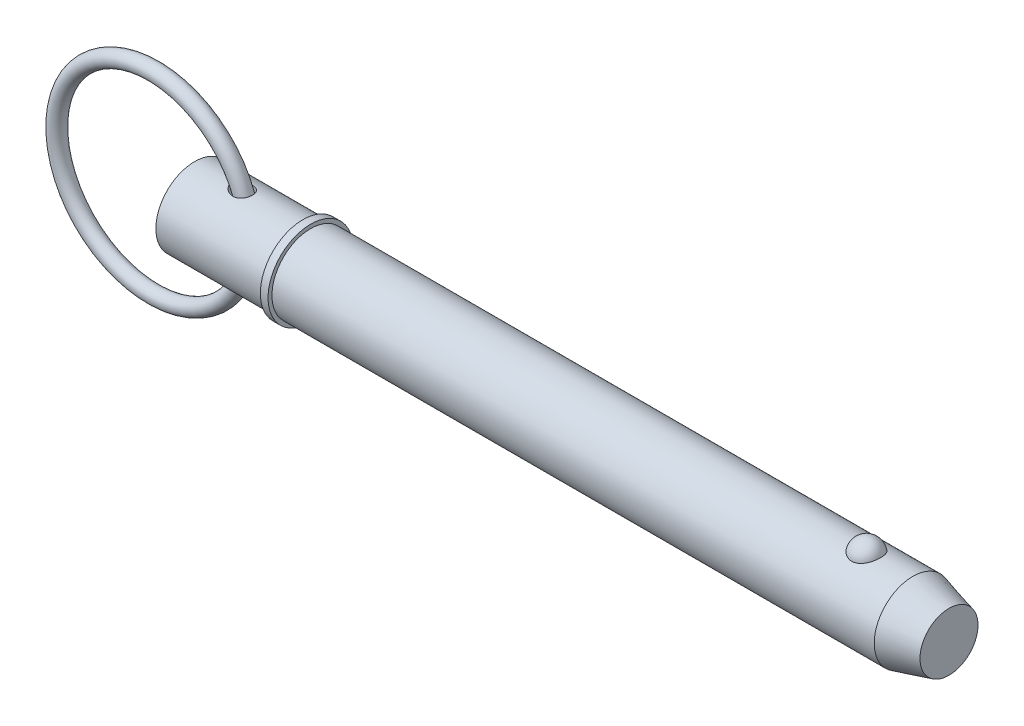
ISO-10303-21;
HEADER;
FILE_DESCRIPTION(('STEP AP214'),'2;1');
FILE_NAME('part.step','',(''),(''),'','','');
FILE_SCHEMA(('AUTOMOTIVE_DESIGN { 1 0 10303 214 1 1 1 1 }'));
ENDSEC;
DATA;
#1=APPLICATION_CONTEXT('core data for automotive mechanical design processes');
#2=APPLICATION_PROTOCOL_DEFINITION('international standard','automotive_design',2000,#1);
#3=PRODUCT_CONTEXT('',#1,'mechanical');
#4=PRODUCT('Part','Part','',(#3));
#5=PRODUCT_RELATED_PRODUCT_CATEGORY('part','',(#4));
#6=PRODUCT_DEFINITION_FORMATION('','',#4);
#7=PRODUCT_DEFINITION_CONTEXT('part definition',#1,'design');
#8=PRODUCT_DEFINITION('design','',#6,#7);
#9=PRODUCT_DEFINITION_SHAPE('','',#8);
#10=(LENGTH_UNIT() NAMED_UNIT(*) SI_UNIT(.MILLI.,.METRE.));
#11=(NAMED_UNIT(*) PLANE_ANGLE_UNIT() SI_UNIT($,.RADIAN.));
#12=(NAMED_UNIT(*) SI_UNIT($,.STERADIAN.) SOLID_ANGLE_UNIT());
#13=UNCERTAINTY_MEASURE_WITH_UNIT(LENGTH_MEASURE(1.E-05),#10,'distance_accuracy_value','');
#14=(GEOMETRIC_REPRESENTATION_CONTEXT(3) GLOBAL_UNCERTAINTY_ASSIGNED_CONTEXT((#13)) GLOBAL_UNIT_ASSIGNED_CONTEXT((#10,
#11,#12)) REPRESENTATION_CONTEXT('',''));
#15=CARTESIAN_POINT('',(0.,0.,0.));
#16=DIRECTION('',(0.,0.,1.));
#17=DIRECTION('',(1.,0.,0.));
#18=AXIS2_PLACEMENT_3D('',#15,#16,#17);
#19=CARTESIAN_POINT('',(-13.4840686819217,0.,0.));
#20=DIRECTION('',(0.,0.,1.));
#21=DIRECTION('',(1.,0.,0.));
#22=AXIS2_PLACEMENT_3D('',#19,#20,#21);
#23=TOROIDAL_SURFACE('',#22,31.75,2.54);
#24=CARTESIAN_POINT('',(20.8059313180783,0.,0.));
#25=VERTEX_POINT('',#24);
#26=VERTEX_LOOP('',#25);
#27=FACE_BOUND('',#26,.T.);
#28=ADVANCED_FACE('P0_F12',(#27),#23,.T.);
#29=CLOSED_SHELL('',(#28));
#30=MANIFOLD_SOLID_BREP('P0_B1',#29);
#31=CARTESIAN_POINT('',(0.,0.,0.));
#32=DIRECTION('',(1.,0.,0.));
#33=DIRECTION('',(0.,0.,-1.));
#34=AXIS2_PLACEMENT_3D('',#31,#32,#33);
#35=CYLINDRICAL_SURFACE('',#34,12.7);
#36=CARTESIAN_POINT('',(13.092900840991,12.5230976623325,-2.11234992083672));
#37=CARTESIAN_POINT('',(13.2535855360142,12.4976398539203,-2.26328363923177));
#38=CARTESIAN_POINT('',(13.4280602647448,12.4718592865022,-2.3995578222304));
#39=CARTESIAN_POINT('',(13.7976341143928,12.4229301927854,-2.64122157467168));
#40=CARTESIAN_POINT('',(13.9927568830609,12.3997847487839,-2.74657519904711));
#41=CARTESIAN_POINT('',(14.397672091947,12.3590534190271,-2.92439761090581));
#42=CARTESIAN_POINT('',(14.6074445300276,12.3414601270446,-2.99691026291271));
#43=CARTESIAN_POINT('',(15.0366557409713,12.3142893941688,-3.10669649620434));
#44=CARTESIAN_POINT('',(15.2560902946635,12.3047084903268,-3.14398530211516));
#45=CARTESIAN_POINT('',(15.5877843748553,12.2976819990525,-3.17128282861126));
#46=CARTESIAN_POINT('',(15.6989364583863,12.2965677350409,-3.17559470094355));
#47=CARTESIAN_POINT('',(15.9211629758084,12.2969101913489,-3.17427486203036));
#48=CARTESIAN_POINT('',(16.0322374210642,12.2983656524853,-3.16864802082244));
#49=CARTESIAN_POINT('',(16.2532861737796,12.3038832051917,-3.14715368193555));
#50=CARTESIAN_POINT('',(16.363260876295,12.3079443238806,-3.13129000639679));
#51=CARTESIAN_POINT('',(16.5810669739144,12.3185954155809,-3.08912320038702));
#52=CARTESIAN_POINT('',(16.6888986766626,12.3251850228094,-3.06282157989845));
#53=CARTESIAN_POINT('',(16.8894247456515,12.3398294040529,-3.00323791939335));
#54=CARTESIAN_POINT('',(16.9824664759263,12.3476389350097,-2.97106098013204));
#55=CARTESIAN_POINT('',(17.1651267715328,12.3648759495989,-2.89848824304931));
#56=CARTESIAN_POINT('',(17.2547457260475,12.3743032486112,-2.85809338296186));
#57=CARTESIAN_POINT('',(17.4297224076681,12.3944822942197,-2.76927391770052));
#58=CARTESIAN_POINT('',(17.5150817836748,12.40523352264,-2.72085245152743));
#59=CARTESIAN_POINT('',(17.6807665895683,12.4277046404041,-2.61629867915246));
#60=CARTESIAN_POINT('',(17.7610923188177,12.4394244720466,-2.56016683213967));
#61=CARTESIAN_POINT('',(17.9797287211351,12.4733252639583,-2.39133767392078));
#62=CARTESIAN_POINT('',(18.1114611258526,12.4961902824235,-2.27005507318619));
#63=CARTESIAN_POINT('',(18.3518677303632,12.5412050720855,-2.00648954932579));
#64=CARTESIAN_POINT('',(18.4605454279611,12.5633549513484,-1.86420981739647));
#65=CARTESIAN_POINT('',(18.6498843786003,12.6039384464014,-1.56614816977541));
#66=CARTESIAN_POINT('',(18.7311185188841,12.622444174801,-1.41073996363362));
#67=CARTESIAN_POINT('',(18.8669149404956,12.6543302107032,-1.08819514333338));
#68=CARTESIAN_POINT('',(18.921477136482,12.6677105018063,-0.921058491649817));
#69=CARTESIAN_POINT('',(19.0028875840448,12.6879542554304,-0.579029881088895));
#70=CARTESIAN_POINT('',(19.0296164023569,12.6947896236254,-0.404107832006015));
#71=CARTESIAN_POINT('',(19.0543673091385,12.7011128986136,-0.0521104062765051));
#72=CARTESIAN_POINT('',(19.0523885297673,12.7006005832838,0.124965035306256));
#73=CARTESIAN_POINT('',(19.019700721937,12.692266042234,0.476969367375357));
#74=CARTESIAN_POINT('',(18.9888798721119,12.6844153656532,0.651887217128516));
#75=CARTESIAN_POINT('',(18.8990221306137,12.6622099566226,0.99389064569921));
#76=CARTESIAN_POINT('',(18.839985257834,12.6478552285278,1.16097622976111));
#77=CARTESIAN_POINT('',(18.6951419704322,12.6142309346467,1.48231767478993));
#78=CARTESIAN_POINT('',(18.6093706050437,12.5949678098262,1.63659000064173));
#79=CARTESIAN_POINT('',(18.4131352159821,12.5536490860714,1.92810749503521));
#80=CARTESIAN_POINT('',(18.3026732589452,12.5315937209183,2.06535408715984));
#81=CARTESIAN_POINT('',(18.060669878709,12.4872833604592,2.31822774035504));
#82=CARTESIAN_POINT('',(17.9292520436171,12.4650302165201,2.43397343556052));
#83=CARTESIAN_POINT('',(17.6485957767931,12.4226514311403,2.64178289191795));
#84=CARTESIAN_POINT('',(17.4993587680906,12.4025256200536,2.73384854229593));
#85=CARTESIAN_POINT('',(17.1869531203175,12.3664726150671,2.8925825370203));
#86=CARTESIAN_POINT('',(17.0237450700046,12.3505578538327,2.95917592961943));
#87=CARTESIAN_POINT('',(16.6884731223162,12.3245177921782,3.06582547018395));
#88=CARTESIAN_POINT('',(16.516407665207,12.3143935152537,3.10587692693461));
#89=CARTESIAN_POINT('',(16.1604213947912,12.3003788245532,3.16093927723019));
#90=CARTESIAN_POINT('',(15.9763106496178,12.2967791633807,3.17478342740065));
#91=CARTESIAN_POINT('',(15.6080973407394,12.2966663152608,3.17521180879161));
#92=CARTESIAN_POINT('',(15.4239948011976,12.3001555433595,3.16178674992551));
#93=CARTESIAN_POINT('',(15.0417156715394,12.3141744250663,3.10676725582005));
#94=CARTESIAN_POINT('',(14.8439465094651,12.3253658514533,3.06251977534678));
#95=CARTESIAN_POINT('',(14.4574652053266,12.3538942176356,2.94531863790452));
#96=CARTESIAN_POINT('',(14.2687614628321,12.3712367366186,2.87233891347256));
#97=CARTESIAN_POINT('',(13.8856104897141,12.4121323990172,2.69045747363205));
#98=CARTESIAN_POINT('',(13.6926012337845,12.4361434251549,2.57861276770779));
#99=CARTESIAN_POINT('',(13.328588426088,12.4862632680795,2.32379935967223));
#100=CARTESIAN_POINT('',(13.1575718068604,12.5123708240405,2.18084927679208));
#101=CARTESIAN_POINT('',(12.8776146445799,12.5579467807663,1.89840233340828));
#102=CARTESIAN_POINT('',(12.7631663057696,12.5776642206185,1.76440341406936));
#103=CARTESIAN_POINT('',(12.5574911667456,12.6143643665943,1.47931295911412));
#104=CARTESIAN_POINT('',(12.4662309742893,12.6313509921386,1.32824646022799));
#105=CARTESIAN_POINT('',(12.3240650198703,12.6583901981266,1.03598403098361));
#106=CARTESIAN_POINT('',(12.2691183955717,12.6691064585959,0.896822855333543));
#107=CARTESIAN_POINT('',(12.1828741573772,12.6860954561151,0.611068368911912));
#108=CARTESIAN_POINT('',(12.1515620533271,12.6923709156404,0.464479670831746));
#109=CARTESIAN_POINT('',(12.1147168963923,12.6997676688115,0.167420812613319));
#110=CARTESIAN_POINT('',(12.1092708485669,12.7008715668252,0.0169392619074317));
#111=CARTESIAN_POINT('',(12.1248234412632,12.6977391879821,-0.282592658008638));
#112=CARTESIAN_POINT('',(12.1458245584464,12.6935024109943,-0.431642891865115));
#113=CARTESIAN_POINT('',(12.210908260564,12.6805581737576,-0.716008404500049));
#114=CARTESIAN_POINT('',(12.2537133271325,12.6720986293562,-0.851633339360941));
#115=CARTESIAN_POINT('',(12.3591295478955,12.6516826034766,-1.11460776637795));
#116=CARTESIAN_POINT('',(12.4217455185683,12.6397252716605,-1.24195523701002));
#117=CARTESIAN_POINT('',(12.5735635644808,12.61152213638,-1.50300095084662));
#118=CARTESIAN_POINT('',(12.6652159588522,12.5949150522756,-1.63522875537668));
#119=CARTESIAN_POINT('',(12.8664347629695,12.5599626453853,-1.88501670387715));
#120=CARTESIAN_POINT('',(12.9760196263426,12.541615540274,-2.0025615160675));
#121=CARTESIAN_POINT('',(13.092900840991,12.5230976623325,-2.11234992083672));
#122=B_SPLINE_CURVE_WITH_KNOTS('',3,(#36,#37,#38,#39,#40,#41,#42,#43,#44,#45,#46,#47,#48,#49,
#50,#51,#52,#53,#54,#55,#56,#57,#58,#59,#60,#61,#62,#63,#64,#65,#66,#67,#68,#69,#70,#71,#72,#73,
#74,#75,#76,#77,#78,#79,#80,#81,#82,#83,#84,#85,#86,#87,#88,#89,#90,#91,#92,#93,#94,#95,#96,#97,
#98,#99,#100,#101,#102,#103,#104,#105,#106,#107,#108,#109,#110,#111,#112,#113,#114,#115,#116,
#117,#118,#119,#120,#121),.UNSPECIFIED.,.T.,.F.,(4,2,2,2,2,2,2,2,2,2,2,2,2,2,2,2,2,2,2,2,2,2,2,
2,2,2,2,2,2,2,2,2,2,2,2,2,2,2,2,2,2,2,4),(0.,0.665132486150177,1.33103515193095,
1.99604575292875,2.66076878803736,2.99410229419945,3.32727250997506,3.66031840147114,
3.99331613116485,4.28918991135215,4.58502994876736,4.88075456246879,5.17646157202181,
5.71510826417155,6.2536731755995,6.78017774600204,7.30668400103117,7.83544030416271,
8.36421259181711,8.89504347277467,9.42587399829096,9.95601150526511,10.4861046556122,
11.0131799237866,11.5402131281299,12.0687854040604,12.5974510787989,13.1491450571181,
13.7010270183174,14.3074556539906,14.914435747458,15.5844380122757,16.2540403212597,
16.7839879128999,17.3131679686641,17.7612578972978,18.2090728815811,18.658393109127,
19.1077554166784,19.5333866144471,19.959121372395,20.4424347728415,20.9262486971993),.UNSPECIFIED.);
#123=CARTESIAN_POINT('',(13.092900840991,12.5230976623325,-2.11234992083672));
#124=VERTEX_POINT('',#123);
#125=EDGE_CURVE('P1_E42',#124,#124,#122,.T.);
#126=ORIENTED_EDGE('',*,*,#125,.T.);
#127=EDGE_LOOP('',(#126));
#128=FACE_BOUND('',#127,.T.);
#129=CARTESIAN_POINT('',(0.,0.,0.));
#130=DIRECTION('',(1.,0.,0.));
#131=DIRECTION('',(0.,0.,-1.));
#132=AXIS2_PLACEMENT_3D('',#129,#130,#131);
#133=CIRCLE('',#132,12.7);
#134=CARTESIAN_POINT('',(0.,0.,-12.7));
#135=VERTEX_POINT('',#134);
#136=EDGE_CURVE('P1_E9',#135,#135,#133,.T.);
#137=ORIENTED_EDGE('',*,*,#136,.T.);
#138=EDGE_LOOP('',(#137));
#139=FACE_BOUND('',#138,.T.);
#140=CARTESIAN_POINT('',(35.56,0.,0.));
#141=DIRECTION('',(1.,0.,0.));
#142=DIRECTION('',(0.,0.,-1.));
#143=AXIS2_PLACEMENT_3D('',#140,#141,#142);
#144=CIRCLE('',#143,12.7);
#145=CARTESIAN_POINT('',(35.56,0.,-12.7));
#146=VERTEX_POINT('',#145);
#147=EDGE_CURVE('P1_E25',#146,#146,#144,.T.);
#148=ORIENTED_EDGE('',*,*,#147,.F.);
#149=EDGE_LOOP('',(#148));
#150=FACE_BOUND('',#149,.T.);
#151=CARTESIAN_POINT('',(13.092900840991,-12.5230976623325,-2.11234992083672));
#152=CARTESIAN_POINT('',(12.9659872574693,-12.5432050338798,-1.99314161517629));
#153=CARTESIAN_POINT('',(12.847667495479,-12.5631124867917,-1.86478966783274));
#154=CARTESIAN_POINT('',(12.6324721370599,-12.6007427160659,-1.59069749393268));
#155=CARTESIAN_POINT('',(12.5355833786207,-12.6184668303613,-1.444968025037));
#156=CARTESIAN_POINT('',(12.409907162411,-12.642034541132,-1.21450950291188));
#157=CARTESIAN_POINT('',(12.3711427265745,-12.6494175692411,-1.13527163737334));
#158=CARTESIAN_POINT('',(12.3010994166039,-12.6628962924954,-0.973464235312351));
#159=CARTESIAN_POINT('',(12.2698164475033,-12.6689926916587,-0.890896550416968));
#160=CARTESIAN_POINT('',(12.2153933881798,-12.6796767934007,-0.723090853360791));
#161=CARTESIAN_POINT('',(12.192246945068,-12.6842656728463,-0.637854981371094));
#162=CARTESIAN_POINT('',(12.154603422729,-12.6917620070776,-0.465421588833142));
#163=CARTESIAN_POINT('',(12.1401047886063,-12.69466976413,-0.378224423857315));
#164=CARTESIAN_POINT('',(12.1214471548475,-12.6984180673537,-0.214417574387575));
#165=CARTESIAN_POINT('',(12.1161713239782,-12.699481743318,-0.137938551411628));
#166=CARTESIAN_POINT('',(12.1124989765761,-12.7002217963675,0.0152189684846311));
#167=CARTESIAN_POINT('',(12.1141046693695,-12.6998977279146,0.0918975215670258));
#168=CARTESIAN_POINT('',(12.1241695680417,-12.6978712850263,0.24474645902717));
#169=CARTESIAN_POINT('',(12.132625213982,-12.6961696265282,0.320917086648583));
#170=CARTESIAN_POINT('',(12.1562110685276,-12.6914452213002,0.472185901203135));
#171=CARTESIAN_POINT('',(12.1713438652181,-12.6884219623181,0.547283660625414));
#172=CARTESIAN_POINT('',(12.223731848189,-12.6780227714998,0.759415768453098));
#173=CARTESIAN_POINT('',(12.268839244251,-12.6691353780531,0.894507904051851));
#174=CARTESIAN_POINT('',(12.3786059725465,-12.6479567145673,1.1560647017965));
#175=CARTESIAN_POINT('',(12.4432700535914,-12.6356646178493,1.28252725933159));
#176=CARTESIAN_POINT('',(12.5971341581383,-12.607236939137,1.5381272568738));
#177=CARTESIAN_POINT('',(12.6882234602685,-12.5908303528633,1.66609325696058));
#178=CARTESIAN_POINT('',(12.887209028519,-12.5564642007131,1.90792082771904));
#179=CARTESIAN_POINT('',(12.995115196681,-12.5385037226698,2.02177401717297));
#180=CARTESIAN_POINT('',(13.2471335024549,-12.4987806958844,2.25547266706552));
#181=CARTESIAN_POINT('',(13.3941979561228,-12.4769622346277,2.3721269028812));
#182=CARTESIAN_POINT('',(13.7036983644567,-12.4349587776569,2.58329351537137));
#183=CARTESIAN_POINT('',(13.8661464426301,-12.4147750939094,2.67778822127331));
#184=CARTESIAN_POINT('',(14.2306024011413,-12.3748157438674,2.85722657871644));
#185=CARTESIAN_POINT('',(14.4347220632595,-12.3556533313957,2.93804226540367));
#186=CARTESIAN_POINT('',(14.8540416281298,-12.3245430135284,3.06594877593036));
#187=CARTESIAN_POINT('',(15.0692453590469,-12.3125976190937,3.11302786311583));
#188=CARTESIAN_POINT('',(15.3981213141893,-12.3014943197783,3.15648626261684));
#189=CARTESIAN_POINT('',(15.5100235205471,-12.298940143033,3.16639841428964));
#190=CARTESIAN_POINT('',(15.7342812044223,-12.2963942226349,3.17627668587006));
#191=CARTESIAN_POINT('',(15.8466364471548,-12.2964012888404,3.1762474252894));
#192=CARTESIAN_POINT('',(16.0707903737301,-12.2990694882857,3.16589868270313));
#193=CARTESIAN_POINT('',(16.1825892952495,-12.3017293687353,3.1555840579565));
#194=CARTESIAN_POINT('',(16.4046123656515,-12.3096862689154,3.12440163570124));
#195=CARTESIAN_POINT('',(16.514836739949,-12.314982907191,3.10353536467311));
#196=CARTESIAN_POINT('',(16.7211934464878,-12.3273933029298,3.05384263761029));
#197=CARTESIAN_POINT('',(16.8175961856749,-12.3342598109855,3.0260738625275));
#198=CARTESIAN_POINT('',(17.0073515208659,-12.3498131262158,2.96195947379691));
#199=CARTESIAN_POINT('',(17.100704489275,-12.3584997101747,2.92561491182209));
#200=CARTESIAN_POINT('',(17.2834584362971,-12.3774243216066,2.84448580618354));
#201=CARTESIAN_POINT('',(17.3728610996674,-12.3876616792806,2.79970490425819));
#202=CARTESIAN_POINT('',(17.5469061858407,-12.409352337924,2.701939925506));
#203=CARTESIAN_POINT('',(17.6315489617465,-12.4208055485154,2.64895645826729));
#204=CARTESIAN_POINT('',(17.7872886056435,-12.4433734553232,2.54070972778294));
#205=CARTESIAN_POINT('',(17.8589017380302,-12.4544123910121,2.48617167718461));
#206=CARTESIAN_POINT('',(17.9970802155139,-12.4768404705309,2.37105291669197));
#207=CARTESIAN_POINT('',(18.063643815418,-12.4882297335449,2.31047013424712));
#208=CARTESIAN_POINT('',(18.1911677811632,-12.5110137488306,2.18372894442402));
#209=CARTESIAN_POINT('',(18.2521311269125,-12.5224084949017,2.11757353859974));
#210=CARTESIAN_POINT('',(18.3680676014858,-12.5448751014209,1.98014449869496));
#211=CARTESIAN_POINT('',(18.4230385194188,-12.5559468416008,1.90886899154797));
#212=CARTESIAN_POINT('',(18.5752306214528,-12.5875288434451,1.69257698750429));
#213=CARTESIAN_POINT('',(18.6637018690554,-12.6071482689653,1.54111740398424));
#214=CARTESIAN_POINT('',(18.8143485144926,-12.6417556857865,1.225260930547));
#215=CARTESIAN_POINT('',(18.876524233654,-12.6567437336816,1.06086419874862));
#216=CARTESIAN_POINT('',(18.9733884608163,-12.6805238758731,0.723195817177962));
#217=CARTESIAN_POINT('',(19.0079967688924,-12.6892978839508,0.549899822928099));
#218=CARTESIAN_POINT('',(19.0486500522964,-12.6996362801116,0.199781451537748));
#219=CARTESIAN_POINT('',(19.054694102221,-12.7012004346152,0.0229589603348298));
#220=CARTESIAN_POINT('',(19.0380549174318,-12.6969431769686,-0.330044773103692));
#221=CARTESIAN_POINT('',(19.0152419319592,-12.6910884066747,-0.506219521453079));
#222=CARTESIAN_POINT('',(18.9411599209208,-12.672565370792,-0.852112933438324));
#223=CARTESIAN_POINT('',(18.8898907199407,-12.659897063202,-1.0218315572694));
#224=CARTESIAN_POINT('',(18.7600888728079,-12.6291327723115,-1.34987035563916));
#225=CARTESIAN_POINT('',(18.6815715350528,-12.6110398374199,-1.50819687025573));
#226=CARTESIAN_POINT('',(18.4991526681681,-12.5714188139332,-1.808997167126));
#227=CARTESIAN_POINT('',(18.3952529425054,-12.5498909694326,-1.95147207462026));
#228=CARTESIAN_POINT('',(18.1653806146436,-12.5059234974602,-2.21580059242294));
#229=CARTESIAN_POINT('',(18.0395297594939,-12.4834893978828,-2.33776101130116));
#230=CARTESIAN_POINT('',(17.7688701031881,-12.4400863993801,-2.55870399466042));
#231=CARTESIAN_POINT('',(17.6240631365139,-12.4191173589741,-2.65768878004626));
#232=CARTESIAN_POINT('',(17.3196803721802,-12.380896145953,-2.8304192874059));
#233=CARTESIAN_POINT('',(17.1601036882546,-12.3636441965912,-2.90416349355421));
#234=CARTESIAN_POINT('',(16.8308162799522,-12.3345597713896,-3.02531546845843));
#235=CARTESIAN_POINT('',(16.6611041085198,-12.322728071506,-3.07271946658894));
#236=CARTESIAN_POINT('',(16.3099674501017,-12.3051318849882,-3.14246490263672));
#237=CARTESIAN_POINT('',(16.1283412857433,-12.2996014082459,-3.16384159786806));
#238=CARTESIAN_POINT('',(15.7639014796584,-12.2955807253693,-3.17942379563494));
#239=CARTESIAN_POINT('',(15.5810875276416,-12.2970924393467,-3.17362188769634));
#240=CARTESIAN_POINT('',(15.20154276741,-12.307074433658,-3.13470416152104));
#241=CARTESIAN_POINT('',(15.0050835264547,-12.316173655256,-3.09911848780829));
#242=CARTESIAN_POINT('',(14.6197996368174,-12.3407987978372,-2.99954607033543));
#243=CARTESIAN_POINT('',(14.4309834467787,-12.3563316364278,-2.93552875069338));
#244=CARTESIAN_POINT('',(14.0353751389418,-12.3949378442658,-2.76840280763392));
#245=CARTESIAN_POINT('',(13.8306109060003,-12.4188242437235,-2.66064798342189));
#246=CARTESIAN_POINT('',(13.4432099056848,-12.4696241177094,-2.4113475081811));
#247=CARTESIAN_POINT('',(13.2605568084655,-12.4965353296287,-2.26982702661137));
#248=CARTESIAN_POINT('',(13.092900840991,-12.5230976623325,-2.11234992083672));
#249=B_SPLINE_CURVE_WITH_KNOTS('',3,(#151,#152,#153,#154,#155,#156,#157,#158,#159,#160,#161,
#162,#163,#164,#165,#166,#167,#168,#169,#170,#171,#172,#173,#174,#175,#176,#177,#178,#179,#180,
#181,#182,#183,#184,#185,#186,#187,#188,#189,#190,#191,#192,#193,#194,#195,#196,#197,#198,#199,
#200,#201,#202,#203,#204,#205,#206,#207,#208,#209,#210,#211,#212,#213,#214,#215,#216,#217,#218,
#219,#220,#221,#222,#223,#224,#225,#226,#227,#228,#229,#230,#231,#232,#233,#234,#235,#236,#237,
#238,#239,#240,#241,#242,#243,#244,#245,#246,#247,#248),.UNSPECIFIED.,.T.,.F.,(4,2,2,2,2,2,2,2,
2,2,2,2,2,2,2,2,2,2,2,2,2,2,2,2,2,2,2,2,2,2,2,2,2,2,2,2,2,2,2,2,2,2,2,2,2,2,2,2,4),(0.,
0.525289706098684,1.05025590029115,1.31549608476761,1.58059075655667,1.84547798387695,
2.11031756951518,2.34000998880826,2.56977615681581,2.79942299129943,3.0291589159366,
3.45531787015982,3.8815803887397,4.35362362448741,4.82594586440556,5.39074449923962,
5.95599200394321,6.61421946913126,7.27267581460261,7.60939383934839,7.9459554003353,
8.2823580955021,8.61871213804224,8.91997243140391,9.22119579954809,9.52228943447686,
9.82336070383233,10.0950952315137,10.3669232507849,10.6386057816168,10.9103882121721,
11.4371688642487,11.9639430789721,12.4922442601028,13.0205625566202,13.5512648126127,
14.0819703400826,14.6123781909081,15.1427483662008,15.6702654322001,16.1977314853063,
16.7252292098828,17.2528024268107,17.7993878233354,18.3461222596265,18.9432829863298,
19.541087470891,20.2355241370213,20.9294447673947),.UNSPECIFIED.);
#250=CARTESIAN_POINT('',(13.092900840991,-12.5230976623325,-2.11234992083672));
#251=VERTEX_POINT('',#250);
#252=EDGE_CURVE('P1_E17',#251,#251,#249,.T.);
#253=ORIENTED_EDGE('',*,*,#252,.T.);
#254=EDGE_LOOP('',(#253));
#255=FACE_BOUND('',#254,.T.);
#256=ADVANCED_FACE('P1_F13',(#128,#139,#150,#255),#35,.T.);
#257=CARTESIAN_POINT('',(0.,0.,0.));
#258=DIRECTION('',(1.,0.,0.));
#259=DIRECTION('',(0.,0.,-1.));
#260=AXIS2_PLACEMENT_3D('',#257,#258,#259);
#261=CYLINDRICAL_SURFACE('',#260,12.7);
#262=CARTESIAN_POINT('',(235.800738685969,0.,0.));
#263=DIRECTION('',(1.,0.,0.));
#264=DIRECTION('',(0.,0.,-1.));
#265=AXIS2_PLACEMENT_3D('',#262,#263,#264);
#266=CIRCLE('',#265,12.7);
#267=CARTESIAN_POINT('',(235.800738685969,0.,-12.7));
#268=VERTEX_POINT('',#267);
#269=EDGE_CURVE('P1_E99',#268,#268,#266,.T.);
#270=ORIENTED_EDGE('',*,*,#269,.F.);
#271=EDGE_LOOP('',(#270));
#272=FACE_BOUND('',#271,.T.);
#273=CARTESIAN_POINT('',(38.1,0.,0.));
#274=DIRECTION('',(1.,0.,0.));
#275=DIRECTION('',(0.,0.,-1.));
#276=AXIS2_PLACEMENT_3D('',#273,#274,#275);
#277=CIRCLE('',#276,12.7);
#278=CARTESIAN_POINT('',(38.1,0.,-12.7));
#279=VERTEX_POINT('',#278);
#280=EDGE_CURVE('P1_E96',#279,#279,#277,.T.);
#281=ORIENTED_EDGE('',*,*,#280,.T.);
#282=EDGE_LOOP('',(#281));
#283=FACE_BOUND('',#282,.T.);
#284=CARTESIAN_POINT('',(220.560042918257,11.7500437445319,4.81938502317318));
#285=CARTESIAN_POINT('',(220.435088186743,11.7500430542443,4.81938571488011));
#286=CARTESIAN_POINT('',(220.310144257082,11.7520975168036,4.81438658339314));
#287=CARTESIAN_POINT('',(220.061142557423,11.760253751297,4.79442904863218));
#288=CARTESIAN_POINT('',(219.937085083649,11.7663568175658,4.77946746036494));
#289=CARTESIAN_POINT('',(219.690901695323,11.7824262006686,4.7397141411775));
#290=CARTESIAN_POINT('',(219.568774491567,11.7923898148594,4.71492928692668));
#291=CARTESIAN_POINT('',(219.327187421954,11.8158938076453,4.65571340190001));
#292=CARTESIAN_POINT('',(219.20772859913,11.8294355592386,4.6212786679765));
#293=CARTESIAN_POINT('',(218.972557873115,11.8596812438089,4.54309502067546));
#294=CARTESIAN_POINT('',(218.856839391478,11.8763792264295,4.49936361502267));
#295=CARTESIAN_POINT('',(218.629653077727,11.9124878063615,4.40287235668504));
#296=CARTESIAN_POINT('',(218.518186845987,11.9318994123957,4.35010914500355));
#297=CARTESIAN_POINT('',(218.191278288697,11.9934256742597,4.17881316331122));
#298=CARTESIAN_POINT('',(217.983127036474,12.038858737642,4.04720756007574));
#299=CARTESIAN_POINT('',(217.585850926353,12.1352173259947,3.748564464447));
#300=CARTESIAN_POINT('',(217.397443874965,12.1862630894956,3.58061821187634));
#301=CARTESIAN_POINT('',(217.050521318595,12.2875163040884,3.21600758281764));
#302=CARTESIAN_POINT('',(216.892011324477,12.3377235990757,3.0193379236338));
#303=CARTESIAN_POINT('',(216.60168878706,12.4344923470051,2.592916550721));
#304=CARTESIAN_POINT('',(216.471376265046,12.4807925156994,2.36208286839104));
#305=CARTESIAN_POINT('',(216.249407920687,12.5623454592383,1.88070399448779));
#306=CARTESIAN_POINT('',(216.157755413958,12.5975972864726,1.63015711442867));
#307=CARTESIAN_POINT('',(216.014046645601,12.6538414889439,1.1129886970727));
#308=CARTESIAN_POINT('',(215.962499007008,12.6746503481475,0.846205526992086));
#309=CARTESIAN_POINT('',(215.901977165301,12.699153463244,0.307085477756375));
#310=CARTESIAN_POINT('',(215.893001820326,12.7028481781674,0.034748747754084));
#311=CARTESIAN_POINT('',(215.917731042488,12.6927785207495,-0.506073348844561));
#312=CARTESIAN_POINT('',(215.951189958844,12.6791146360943,-0.774571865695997));
#313=CARTESIAN_POINT('',(216.059687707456,12.635882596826,-1.30170246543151));
#314=CARTESIAN_POINT('',(216.13472729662,12.606314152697,-1.56033436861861));
#315=CARTESIAN_POINT('',(216.325000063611,12.5342328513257,-2.0608389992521));
#316=CARTESIAN_POINT('',(216.440287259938,12.4917026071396,-2.30268867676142));
#317=CARTESIAN_POINT('',(216.708704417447,12.3981123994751,-2.76259600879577));
#318=CARTESIAN_POINT('',(216.861837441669,12.3470517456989,-2.98065173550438));
#319=CARTESIAN_POINT('',(217.203507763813,12.2416045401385,-3.38786328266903));
#320=CARTESIAN_POINT('',(217.392201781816,12.1872040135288,-3.57688418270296));
#321=CARTESIAN_POINT('',(217.800239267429,12.0814086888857,-3.91941073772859));
#322=CARTESIAN_POINT('',(218.019580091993,12.0300136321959,-4.07291945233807));
#323=CARTESIAN_POINT('',(218.478375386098,11.9373542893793,-4.33691289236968));
#324=CARTESIAN_POINT('',(218.717304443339,11.8958982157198,-4.44824125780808));
#325=CARTESIAN_POINT('',(219.21243761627,11.8268116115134,-4.62881985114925));
#326=CARTESIAN_POINT('',(219.468635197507,11.7991758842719,-4.69808589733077));
#327=CARTESIAN_POINT('',(219.977164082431,11.7622209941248,-4.78983181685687));
#328=CARTESIAN_POINT('',(220.229041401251,11.7520502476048,-4.81449025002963));
#329=CARTESIAN_POINT('',(220.733573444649,11.7485796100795,-4.82295735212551));
#330=CARTESIAN_POINT('',(220.986228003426,11.7552763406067,-4.80677420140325));
#331=CARTESIAN_POINT('',(221.476834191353,11.7842584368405,-4.73525430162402));
#332=CARTESIAN_POINT('',(221.714998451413,11.8060486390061,-4.68116061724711));
#333=CARTESIAN_POINT('',(222.178489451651,11.8622750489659,-4.53678133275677));
#334=CARTESIAN_POINT('',(222.403815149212,11.8967122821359,-4.44649279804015));
#335=CARTESIAN_POINT('',(222.840801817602,11.9754603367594,-4.2298761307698));
#336=CARTESIAN_POINT('',(223.052057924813,12.0199699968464,-4.10280539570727));
#337=CARTESIAN_POINT('',(223.450601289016,12.1138028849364,-3.81685409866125));
#338=CARTESIAN_POINT('',(223.637883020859,12.163127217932,-3.65796622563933));
#339=CARTESIAN_POINT('',(223.993350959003,12.2642343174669,-3.30364864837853));
#340=CARTESIAN_POINT('',(224.160111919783,12.3160165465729,-3.10678783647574));
#341=CARTESIAN_POINT('',(224.459579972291,12.4142566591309,-2.68748409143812));
#342=CARTESIAN_POINT('',(224.592280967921,12.4607135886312,-2.4650365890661));
#343=CARTESIAN_POINT('',(224.824691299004,12.5450236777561,-1.9928951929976));
#344=CARTESIAN_POINT('',(224.923215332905,12.5825557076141,-1.74255918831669));
#345=CARTESIAN_POINT('',(225.079227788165,12.6431720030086,-1.22773734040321));
#346=CARTESIAN_POINT('',(225.136715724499,12.6662560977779,-0.963251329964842));
#347=CARTESIAN_POINT('',(225.209544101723,12.6956486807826,-0.4273550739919));
#348=CARTESIAN_POINT('',(225.224837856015,12.7019385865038,-0.155937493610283));
#349=CARTESIAN_POINT('',(225.212779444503,12.6970201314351,0.385928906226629));
#350=CARTESIAN_POINT('',(225.18542805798,12.6858120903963,0.656377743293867));
#351=CARTESIAN_POINT('',(225.113060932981,12.6568455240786,1.05454017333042));
#352=CARTESIAN_POINT('',(225.083796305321,12.6451962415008,1.18577850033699));
#353=CARTESIAN_POINT('',(225.015022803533,12.6181819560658,1.4451380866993));
#354=CARTESIAN_POINT('',(224.975517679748,12.6028183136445,1.57326046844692));
#355=CARTESIAN_POINT('',(224.886439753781,12.5687547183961,1.82554978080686));
#356=CARTESIAN_POINT('',(224.836862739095,12.5500533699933,1.9497150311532));
#357=CARTESIAN_POINT('',(224.72792115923,12.5098093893,2.19314370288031));
#358=CARTESIAN_POINT('',(224.668560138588,12.4882677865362,2.31240887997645));
#359=CARTESIAN_POINT('',(224.53997128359,12.4427679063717,2.5459303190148));
#360=CARTESIAN_POINT('',(224.470688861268,12.4187964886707,2.66015396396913));
#361=CARTESIAN_POINT('',(224.322903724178,12.3691892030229,2.88202659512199));
#362=CARTESIAN_POINT('',(224.244404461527,12.3435539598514,2.98967802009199));
#363=CARTESIAN_POINT('',(224.078550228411,12.2912955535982,3.1977438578));
#364=CARTESIAN_POINT('',(223.991191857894,12.2646720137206,3.298155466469));
#365=CARTESIAN_POINT('',(223.808161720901,12.2111945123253,3.49095035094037));
#366=CARTESIAN_POINT('',(223.712493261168,12.1843406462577,3.58333679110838));
#367=CARTESIAN_POINT('',(223.513627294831,12.1312249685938,3.75922876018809));
#368=CARTESIAN_POINT('',(223.410450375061,12.104961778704,3.84275713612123));
#369=CARTESIAN_POINT('',(223.19701336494,12.0537284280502,4.00056406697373));
#370=CARTESIAN_POINT('',(223.086756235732,12.028757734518,4.07484645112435));
#371=CARTESIAN_POINT('',(222.859755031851,11.9808306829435,4.21367959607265));
#372=CARTESIAN_POINT('',(222.743006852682,11.9578756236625,4.27822410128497));
#373=CARTESIAN_POINT('',(222.50394258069,11.9147184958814,4.39698483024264));
#374=CARTESIAN_POINT('',(222.381628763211,11.894515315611,4.45120522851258));
#375=CARTESIAN_POINT('',(222.122952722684,11.8561129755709,4.55255353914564));
#376=CARTESIAN_POINT('',(221.986223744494,11.8381764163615,4.59884858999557));
#377=CARTESIAN_POINT('',(221.708608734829,11.8069093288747,4.67853897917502));
#378=CARTESIAN_POINT('',(221.567724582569,11.7935767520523,4.71194005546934));
#379=CARTESIAN_POINT('',(221.28309446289,11.7720277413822,4.76552188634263));
#380=CARTESIAN_POINT('',(221.139348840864,11.7638106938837,4.78570422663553));
#381=CARTESIAN_POINT('',(220.850411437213,11.7528195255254,4.81263433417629));
#382=CARTESIAN_POINT('',(220.705219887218,11.7500445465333,4.81938421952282));
#383=CARTESIAN_POINT('',(220.560042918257,11.7500437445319,4.81938502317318));
#384=B_SPLINE_CURVE_WITH_KNOTS('',3,(#284,#285,#286,#287,#288,#289,#290,#291,#292,#293,#294,
#295,#296,#297,#298,#299,#300,#301,#302,#303,#304,#305,#306,#307,#308,#309,#310,#311,#312,#313,
#314,#315,#316,#317,#318,#319,#320,#321,#322,#323,#324,#325,#326,#327,#328,#329,#330,#331,#332,
#333,#334,#335,#336,#337,#338,#339,#340,#341,#342,#343,#344,#345,#346,#347,#348,#349,#350,#351,
#352,#353,#354,#355,#356,#357,#358,#359,#360,#361,#362,#363,#364,#365,#366,#367,#368,#369,#370,
#371,#372,#373,#374,#375,#376,#377,#378,#379,#380,#381,#382,#383),.UNSPECIFIED.,.T.,.F.,(4,2,2,
2,2,2,2,2,2,2,2,2,2,2,2,2,2,2,2,2,2,2,2,2,2,2,2,2,2,2,2,2,2,2,2,2,2,2,2,2,2,2,2,2,2,2,2,2,2,4),
(0.,0.374729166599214,0.749578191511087,1.12416526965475,1.49889629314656,1.87292776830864,
2.24709865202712,2.99481328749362,3.76399449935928,4.53331735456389,5.3368391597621,
6.14042986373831,6.95405296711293,7.76765424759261,8.57656703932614,9.38549455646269,
10.1955119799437,11.0055949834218,11.8193353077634,12.6330054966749,13.4294141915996,
14.2255231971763,14.9815786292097,15.7374826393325,16.4696948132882,17.2019663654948,
17.9501979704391,18.6986017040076,19.4844704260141,20.2704797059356,21.0815215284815,
21.8925729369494,22.7045213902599,23.5164550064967,23.9209608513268,24.3253187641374,
24.7298461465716,25.1342272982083,25.54092555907,25.947471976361,26.3541750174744,
26.7607169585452,27.1661834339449,27.5714814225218,27.9770386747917,28.3824315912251,
28.818120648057,29.2536155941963,29.6890582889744,30.1244323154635),.UNSPECIFIED.);
#385=CARTESIAN_POINT('',(220.560042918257,11.7500437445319,4.81938502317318));
#386=VERTEX_POINT('',#385);
#387=EDGE_CURVE('P1_E34',#386,#386,#384,.T.);
#388=ORIENTED_EDGE('',*,*,#387,.T.);
#389=EDGE_LOOP('',(#388));
#390=FACE_BOUND('',#389,.T.);
#391=ADVANCED_FACE('P1_F46',(#272,#283,#390),#261,.T.);
#392=CARTESIAN_POINT('',(0.,0.,0.));
#393=DIRECTION('',(-1.,0.,0.));
#394=DIRECTION('',(0.,0.,1.));
#395=AXIS2_PLACEMENT_3D('',#392,#393,#394);
#396=PLANE('',#395);
#397=ORIENTED_EDGE('',*,*,#136,.F.);
#398=EDGE_LOOP('',(#397));
#399=FACE_BOUND('',#398,.T.);
#400=ADVANCED_FACE('P1_F15',(#399),#396,.T.);
#401=CARTESIAN_POINT('',(35.56,12.7,0.));
#402=DIRECTION('',(-1.,0.,0.));
#403=DIRECTION('',(0.,0.,1.));
#404=AXIS2_PLACEMENT_3D('',#401,#402,#403);
#405=PLANE('',#404);
#406=ORIENTED_EDGE('',*,*,#147,.T.);
#407=EDGE_LOOP('',(#406));
#408=FACE_BOUND('',#407,.T.);
#409=CARTESIAN_POINT('',(35.56,0.,0.));
#410=DIRECTION('',(1.,0.,0.));
#411=DIRECTION('',(0.,0.,-1.));
#412=AXIS2_PLACEMENT_3D('',#409,#410,#411);
#413=CIRCLE('',#412,13.97);
#414=CARTESIAN_POINT('',(35.56,0.,-13.97));
#415=VERTEX_POINT('',#414);
#416=EDGE_CURVE('P1_E30',#415,#415,#413,.T.);
#417=ORIENTED_EDGE('',*,*,#416,.F.);
#418=EDGE_LOOP('',(#417));
#419=FACE_BOUND('',#418,.T.);
#420=ADVANCED_FACE('P1_F81',(#408,#419),#405,.T.);
#421=CARTESIAN_POINT('',(0.,0.,0.));
#422=DIRECTION('',(1.,0.,0.));
#423=DIRECTION('',(0.,0.,-1.));
#424=AXIS2_PLACEMENT_3D('',#421,#422,#423);
#425=CYLINDRICAL_SURFACE('',#424,13.97);
#426=ORIENTED_EDGE('',*,*,#416,.T.);
#427=EDGE_LOOP('',(#426));
#428=FACE_BOUND('',#427,.T.);
#429=CARTESIAN_POINT('',(38.1,0.,0.));
#430=DIRECTION('',(1.,0.,0.));
#431=DIRECTION('',(0.,0.,-1.));
#432=AXIS2_PLACEMENT_3D('',#429,#430,#431);
#433=CIRCLE('',#432,13.97);
#434=CARTESIAN_POINT('',(38.1,0.,-13.97));
#435=VERTEX_POINT('',#434);
#436=EDGE_CURVE('P1_E95',#435,#435,#433,.T.);
#437=ORIENTED_EDGE('',*,*,#436,.F.);
#438=EDGE_LOOP('',(#437));
#439=FACE_BOUND('',#438,.T.);
#440=ADVANCED_FACE('P1_F68',(#428,#439),#425,.T.);
#441=CARTESIAN_POINT('',(38.1,13.97,0.));
#442=DIRECTION('',(1.,0.,0.));
#443=DIRECTION('',(0.,0.,-1.));
#444=AXIS2_PLACEMENT_3D('',#441,#442,#443);
#445=PLANE('',#444);
#446=ORIENTED_EDGE('',*,*,#436,.T.);
#447=EDGE_LOOP('',(#446));
#448=FACE_BOUND('',#447,.T.);
#449=ORIENTED_EDGE('',*,*,#280,.F.);
#450=EDGE_LOOP('',(#449));
#451=FACE_BOUND('',#450,.T.);
#452=ADVANCED_FACE('P1_F62',(#448,#451),#445,.T.);
#453=CARTESIAN_POINT('',(247.65,0.,0.));
#454=DIRECTION('',(-1.,0.,0.));
#455=DIRECTION('',(0.,0.,1.));
#456=AXIS2_PLACEMENT_3D('',#453,#454,#455);
#457=CONICAL_SURFACE('',#456,9.52500000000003,0.26179938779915);
#458=ORIENTED_EDGE('',*,*,#269,.T.);
#459=EDGE_LOOP('',(#458));
#460=FACE_BOUND('',#459,.T.);
#461=CARTESIAN_POINT('',(247.65,0.,0.));
#462=DIRECTION('',(1.,0.,0.));
#463=DIRECTION('',(0.,0.,-1.));
#464=AXIS2_PLACEMENT_3D('',#461,#462,#463);
#465=CIRCLE('',#464,9.52500000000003);
#466=CARTESIAN_POINT('',(247.65,0.,-9.52500000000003));
#467=VERTEX_POINT('',#466);
#468=EDGE_CURVE('P1_E41',#467,#467,#465,.T.);
#469=ORIENTED_EDGE('',*,*,#468,.F.);
#470=EDGE_LOOP('',(#469));
#471=FACE_BOUND('',#470,.T.);
#472=ADVANCED_FACE('P1_F59',(#460,#471),#457,.T.);
#473=CARTESIAN_POINT('',(247.65,9.52500000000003,0.));
#474=DIRECTION('',(1.,0.,0.));
#475=DIRECTION('',(0.,0.,-1.));
#476=AXIS2_PLACEMENT_3D('',#473,#474,#475);
#477=PLANE('',#476);
#478=ORIENTED_EDGE('',*,*,#468,.T.);
#479=EDGE_LOOP('',(#478));
#480=FACE_BOUND('',#479,.T.);
#481=ADVANCED_FACE('P1_F55',(#480),#477,.T.);
#482=CARTESIAN_POINT('',(220.560042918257,11.43,0.));
#483=DIRECTION('',(-1.,0.,0.));
#484=DIRECTION('',(0.,1.,0.));
#485=AXIS2_PLACEMENT_3D('',#482,#483,#484);
#486=SPHERICAL_SURFACE('',#485,4.83);
#487=ORIENTED_EDGE('',*,*,#387,.F.);
#488=EDGE_LOOP('',(#487));
#489=FACE_BOUND('',#488,.T.);
#490=ADVANCED_FACE('P1_F50',(#489),#486,.T.);
#491=CARTESIAN_POINT('',(-13.4840686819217,0.,0.));
#492=DIRECTION('',(0.,0.,1.));
#493=DIRECTION('',(1.,0.,0.));
#494=AXIS2_PLACEMENT_3D('',#491,#492,#493);
#495=TOROIDAL_SURFACE('',#494,31.75,3.175);
#496=ORIENTED_EDGE('',*,*,#252,.F.);
#497=EDGE_LOOP('',(#496));
#498=FACE_BOUND('',#497,.T.);
#499=ORIENTED_EDGE('',*,*,#125,.F.);
#500=EDGE_LOOP('',(#499));
#501=FACE_BOUND('',#500,.T.);
#502=ADVANCED_FACE('P1_F54',(#498,#501),#495,.F.);
#503=CLOSED_SHELL('',(#256,#391,#400,#420,#440,#452,#472,#481,#490,#502));
#504=MANIFOLD_SOLID_BREP('P1_B1',#503);
#505=ADVANCED_BREP_SHAPE_REPRESENTATION('',(#18,#30,#504),#14);
#506=SHAPE_DEFINITION_REPRESENTATION(#9,#505);
ENDSEC;
END-ISO-10303-21;
